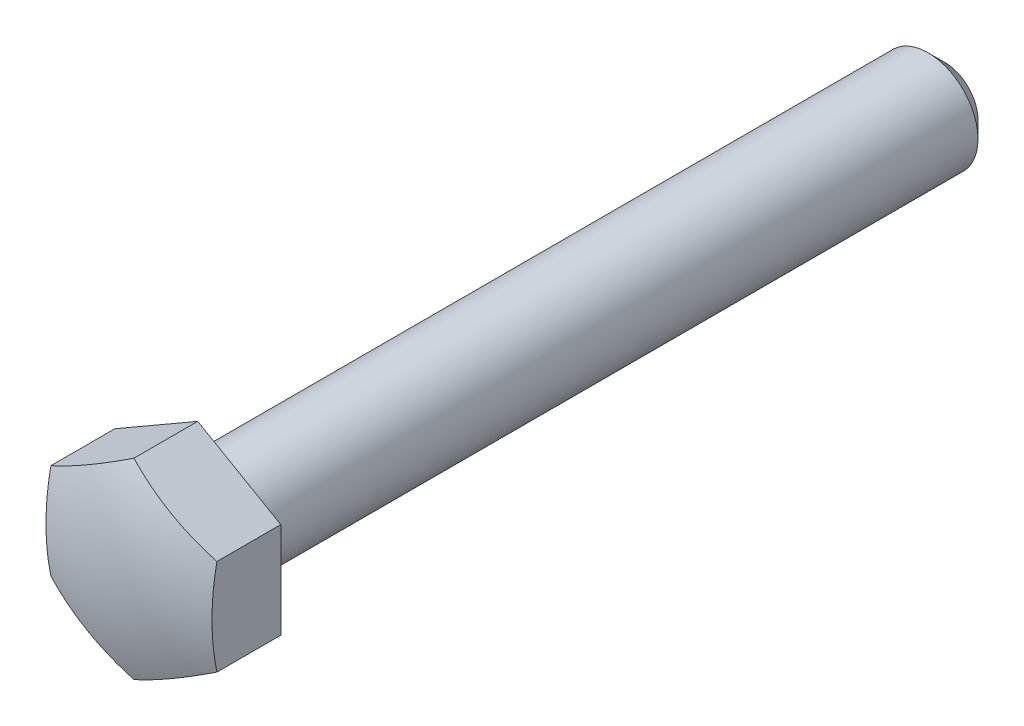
ISO-10303-21;
HEADER;
FILE_DESCRIPTION(('STEP AP214'),'2;1');
FILE_NAME('part.step','',(''),(''),'','','');
FILE_SCHEMA(('AUTOMOTIVE_DESIGN { 1 0 10303 214 1 1 1 1 }'));
ENDSEC;
DATA;
#1=APPLICATION_CONTEXT('core data for automotive mechanical design processes');
#2=APPLICATION_PROTOCOL_DEFINITION('international standard','automotive_design',2000,#1);
#3=PRODUCT_CONTEXT('',#1,'mechanical');
#4=PRODUCT('Part','Part','',(#3));
#5=PRODUCT_RELATED_PRODUCT_CATEGORY('part','',(#4));
#6=PRODUCT_DEFINITION_FORMATION('','',#4);
#7=PRODUCT_DEFINITION_CONTEXT('part definition',#1,'design');
#8=PRODUCT_DEFINITION('design','',#6,#7);
#9=PRODUCT_DEFINITION_SHAPE('','',#8);
#10=(LENGTH_UNIT() NAMED_UNIT(*) SI_UNIT(.MILLI.,.METRE.));
#11=(NAMED_UNIT(*) PLANE_ANGLE_UNIT() SI_UNIT($,.RADIAN.));
#12=(NAMED_UNIT(*) SI_UNIT($,.STERADIAN.) SOLID_ANGLE_UNIT());
#13=UNCERTAINTY_MEASURE_WITH_UNIT(LENGTH_MEASURE(1.E-05),#10,'distance_accuracy_value','');
#14=(GEOMETRIC_REPRESENTATION_CONTEXT(3) GLOBAL_UNCERTAINTY_ASSIGNED_CONTEXT((#13)) GLOBAL_UNIT_ASSIGNED_CONTEXT((#10,
#11,#12)) REPRESENTATION_CONTEXT('',''));
#15=CARTESIAN_POINT('',(0.,0.,0.));
#16=DIRECTION('',(0.,0.,1.));
#17=DIRECTION('',(1.,0.,0.));
#18=AXIS2_PLACEMENT_3D('',#15,#16,#17);
#19=CARTESIAN_POINT('',(3.,0.,0.));
#20=DIRECTION('',(0.,0.,1.));
#21=DIRECTION('',(1.,0.,0.));
#22=AXIS2_PLACEMENT_3D('',#19,#20,#21);
#23=PLANE('',#22);
#24=CARTESIAN_POINT('',(0.,0.,0.));
#25=DIRECTION('',(0.,0.,1.));
#26=DIRECTION('',(1.,0.,0.));
#27=AXIS2_PLACEMENT_3D('',#24,#25,#26);
#28=CIRCLE('',#27,3.);
#29=CARTESIAN_POINT('',(3.,0.,0.));
#30=VERTEX_POINT('',#29);
#31=EDGE_CURVE('E115',#30,#30,#28,.T.);
#32=ORIENTED_EDGE('',*,*,#31,.T.);
#33=EDGE_LOOP('',(#32));
#34=FACE_BOUND('',#33,.T.);
#35=DIRECTION('',(-0.86602540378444,-0.5,0.));
#36=VECTOR('',#35,1.);
#37=CARTESIAN_POINT('',(5.,-2.88675134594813,0.));
#38=LINE('',#37,#36);
#39=CARTESIAN_POINT('',(5.,-2.88675134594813,0.));
#40=VERTEX_POINT('',#39);
#41=CARTESIAN_POINT('',(0.,-5.77350269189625,0.));
#42=VERTEX_POINT('',#41);
#43=EDGE_CURVE('E89',#40,#42,#38,.T.);
#44=ORIENTED_EDGE('',*,*,#43,.T.);
#45=DIRECTION('',(0.86602540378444,-0.5,0.));
#46=VECTOR('',#45,1.);
#47=CARTESIAN_POINT('',(-5.,-2.88675134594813,0.));
#48=LINE('',#47,#46);
#49=CARTESIAN_POINT('',(-5.,-2.88675134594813,0.));
#50=VERTEX_POINT('',#49);
#51=EDGE_CURVE('E87',#50,#42,#48,.T.);
#52=ORIENTED_EDGE('',*,*,#51,.F.);
#53=DIRECTION('',(0.,-1.,0.));
#54=VECTOR('',#53,1.);
#55=CARTESIAN_POINT('',(-5.,2.88675134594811,0.));
#56=LINE('',#55,#54);
#57=CARTESIAN_POINT('',(-5.,2.88675134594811,0.));
#58=VERTEX_POINT('',#57);
#59=EDGE_CURVE('E37',#58,#50,#56,.T.);
#60=ORIENTED_EDGE('',*,*,#59,.F.);
#61=DIRECTION('',(0.866025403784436,0.5,0.));
#62=VECTOR('',#61,1.);
#63=CARTESIAN_POINT('',(-5.,2.88675134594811,0.));
#64=LINE('',#63,#62);
#65=CARTESIAN_POINT('',(0.,5.77350269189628,0.));
#66=VERTEX_POINT('',#65);
#67=EDGE_CURVE('E77',#58,#66,#64,.T.);
#68=ORIENTED_EDGE('',*,*,#67,.T.);
#69=DIRECTION('',(-0.866025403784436,0.5,0.));
#70=VECTOR('',#69,1.);
#71=CARTESIAN_POINT('',(5.,2.88675134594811,0.));
#72=LINE('',#71,#70);
#73=CARTESIAN_POINT('',(5.,2.88675134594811,0.));
#74=VERTEX_POINT('',#73);
#75=EDGE_CURVE('E83',#74,#66,#72,.T.);
#76=ORIENTED_EDGE('',*,*,#75,.F.);
#77=DIRECTION('',(0.,-1.,0.));
#78=VECTOR('',#77,1.);
#79=CARTESIAN_POINT('',(5.,2.88675134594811,0.));
#80=LINE('',#79,#78);
#81=EDGE_CURVE('E95',#74,#40,#80,.T.);
#82=ORIENTED_EDGE('',*,*,#81,.T.);
#83=EDGE_LOOP('',(#44,#52,#60,#68,#76,#82));
#84=FACE_BOUND('',#83,.T.);
#85=ADVANCED_FACE('F14',(#34,#84),#23,.F.);
#86=CARTESIAN_POINT('',(0.,0.,15.));
#87=DIRECTION('',(0.,0.,1.));
#88=DIRECTION('',(1.,0.,0.));
#89=AXIS2_PLACEMENT_3D('',#86,#87,#88);
#90=CYLINDRICAL_SURFACE('',#89,3.);
#91=CARTESIAN_POINT('',(0.,0.,-44.));
#92=DIRECTION('',(0.,0.,1.));
#93=DIRECTION('',(1.,0.,0.));
#94=AXIS2_PLACEMENT_3D('',#91,#92,#93);
#95=CIRCLE('',#94,3.);
#96=CARTESIAN_POINT('',(3.,0.,-44.));
#97=VERTEX_POINT('',#96);
#98=EDGE_CURVE('E22',#97,#97,#95,.T.);
#99=ORIENTED_EDGE('',*,*,#98,.T.);
#100=EDGE_LOOP('',(#99));
#101=FACE_BOUND('',#100,.T.);
#102=ORIENTED_EDGE('',*,*,#31,.F.);
#103=EDGE_LOOP('',(#102));
#104=FACE_BOUND('',#103,.T.);
#105=ADVANCED_FACE('F120',(#101,#104),#90,.T.);
#106=CARTESIAN_POINT('',(0.,0.,-45.));
#107=DIRECTION('',(0.,0.,1.));
#108=DIRECTION('',(1.,0.,0.));
#109=AXIS2_PLACEMENT_3D('',#106,#107,#108);
#110=PLANE('',#109);
#111=CARTESIAN_POINT('',(0.,0.,-45.));
#112=DIRECTION('',(0.,0.,1.));
#113=DIRECTION('',(1.,0.,0.));
#114=AXIS2_PLACEMENT_3D('',#111,#112,#113);
#115=CIRCLE('',#114,2.);
#116=CARTESIAN_POINT('',(2.,0.,-45.));
#117=VERTEX_POINT('',#116);
#118=EDGE_CURVE('E9',#117,#117,#115,.F.);
#119=ORIENTED_EDGE('',*,*,#118,.T.);
#120=EDGE_LOOP('',(#119));
#121=FACE_BOUND('',#120,.T.);
#122=ADVANCED_FACE('F141',(#121),#110,.F.);
#123=CARTESIAN_POINT('',(5.,-2.88675134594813,5.));
#124=DIRECTION('',(0.5,-0.86602540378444,0.));
#125=DIRECTION('',(0.86602540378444,0.5,0.));
#126=AXIS2_PLACEMENT_3D('',#123,#124,#125);
#127=PLANE('',#126);
#128=DIRECTION('',(0.,0.,-1.));
#129=VECTOR('',#128,1.);
#130=CARTESIAN_POINT('',(0.,-5.77350269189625,5.));
#131=LINE('',#130,#129);
#132=CARTESIAN_POINT('',(0.,-5.77350269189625,3.8443731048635));
#133=VERTEX_POINT('',#132);
#134=EDGE_CURVE('E29',#133,#42,#131,.T.);
#135=ORIENTED_EDGE('',*,*,#134,.T.);
#136=ORIENTED_EDGE('',*,*,#43,.F.);
#137=DIRECTION('',(0.,0.,-1.));
#138=VECTOR('',#137,1.);
#139=CARTESIAN_POINT('',(5.,-2.88675134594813,5.));
#140=LINE('',#139,#138);
#141=CARTESIAN_POINT('',(5.,-2.88675134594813,3.8443731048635));
#142=VERTEX_POINT('',#141);
#143=EDGE_CURVE('E100',#142,#40,#140,.T.);
#144=ORIENTED_EDGE('',*,*,#143,.F.);
#145=CARTESIAN_POINT('',(2.5,-4.3301270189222,-10.));
#146=DIRECTION('',(0.5,-0.86602540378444,0.));
#147=DIRECTION('',(0.86602540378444,0.5,0.));
#148=AXIS2_PLACEMENT_3D('',#145,#146,#147);
#149=CIRCLE('',#148,14.1421356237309);
#150=EDGE_CURVE('E112',#133,#142,#149,.F.);
#151=ORIENTED_EDGE('',*,*,#150,.F.);
#152=EDGE_LOOP('',(#135,#136,#144,#151));
#153=FACE_BOUND('',#152,.T.);
#154=ADVANCED_FACE('F146',(#153),#127,.T.);
#155=CARTESIAN_POINT('',(5.,2.88675134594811,5.));
#156=DIRECTION('',(1.,0.,0.));
#157=DIRECTION('',(0.,0.,-1.));
#158=AXIS2_PLACEMENT_3D('',#155,#156,#157);
#159=PLANE('',#158);
#160=ORIENTED_EDGE('',*,*,#143,.T.);
#161=ORIENTED_EDGE('',*,*,#81,.F.);
#162=DIRECTION('',(0.,0.,-1.));
#163=VECTOR('',#162,1.);
#164=CARTESIAN_POINT('',(5.,2.88675134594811,5.));
#165=LINE('',#164,#163);
#166=CARTESIAN_POINT('',(5.,2.88675134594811,3.8443731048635));
#167=VERTEX_POINT('',#166);
#168=EDGE_CURVE('E98',#167,#74,#165,.T.);
#169=ORIENTED_EDGE('',*,*,#168,.F.);
#170=CARTESIAN_POINT('',(5.,0.,-10.));
#171=DIRECTION('',(1.,0.,0.));
#172=DIRECTION('',(0.,0.,-1.));
#173=AXIS2_PLACEMENT_3D('',#170,#171,#172);
#174=CIRCLE('',#173,14.1421356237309);
#175=EDGE_CURVE('E109',#142,#167,#174,.F.);
#176=ORIENTED_EDGE('',*,*,#175,.F.);
#177=EDGE_LOOP('',(#160,#161,#169,#176));
#178=FACE_BOUND('',#177,.T.);
#179=ADVANCED_FACE('F148',(#178),#159,.T.);
#180=CARTESIAN_POINT('',(5.,2.88675134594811,5.));
#181=DIRECTION('',(-0.5,-0.866025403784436,0.));
#182=DIRECTION('',(0.866025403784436,-0.5,0.));
#183=AXIS2_PLACEMENT_3D('',#180,#181,#182);
#184=PLANE('',#183);
#185=CARTESIAN_POINT('',(2.5,4.33012701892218,-10.));
#186=DIRECTION('',(-0.5,-0.866025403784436,0.));
#187=DIRECTION('',(0.866025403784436,-0.5,0.));
#188=AXIS2_PLACEMENT_3D('',#185,#186,#187);
#189=CIRCLE('',#188,14.1421356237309);
#190=CARTESIAN_POINT('',(0.,5.77350269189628,3.8443731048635));
#191=VERTEX_POINT('',#190);
#192=EDGE_CURVE('E107',#191,#167,#189,.F.);
#193=ORIENTED_EDGE('',*,*,#192,.T.);
#194=ORIENTED_EDGE('',*,*,#168,.T.);
#195=ORIENTED_EDGE('',*,*,#75,.T.);
#196=DIRECTION('',(0.,0.,-1.));
#197=VECTOR('',#196,1.);
#198=CARTESIAN_POINT('',(0.,5.77350269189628,5.));
#199=LINE('',#198,#197);
#200=EDGE_CURVE('E73',#191,#66,#199,.T.);
#201=ORIENTED_EDGE('',*,*,#200,.F.);
#202=EDGE_LOOP('',(#193,#194,#195,#201));
#203=FACE_BOUND('',#202,.T.);
#204=ADVANCED_FACE('F151',(#203),#184,.F.);
#205=CARTESIAN_POINT('',(-5.,2.88675134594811,5.));
#206=DIRECTION('',(-0.5,0.866025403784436,0.));
#207=DIRECTION('',(-0.866025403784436,-0.5,0.));
#208=AXIS2_PLACEMENT_3D('',#205,#206,#207);
#209=PLANE('',#208);
#210=ORIENTED_EDGE('',*,*,#200,.T.);
#211=ORIENTED_EDGE('',*,*,#67,.F.);
#212=DIRECTION('',(0.,0.,-1.));
#213=VECTOR('',#212,1.);
#214=CARTESIAN_POINT('',(-5.,2.88675134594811,5.));
#215=LINE('',#214,#213);
#216=CARTESIAN_POINT('',(-5.,2.88675134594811,3.8443731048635));
#217=VERTEX_POINT('',#216);
#218=EDGE_CURVE('E66',#217,#58,#215,.T.);
#219=ORIENTED_EDGE('',*,*,#218,.F.);
#220=CARTESIAN_POINT('',(-2.5,4.33012701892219,-10.));
#221=DIRECTION('',(-0.5,0.866025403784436,0.));
#222=DIRECTION('',(-0.866025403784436,-0.5,0.));
#223=AXIS2_PLACEMENT_3D('',#220,#221,#222);
#224=CIRCLE('',#223,14.1421356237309);
#225=EDGE_CURVE('E105',#191,#217,#224,.F.);
#226=ORIENTED_EDGE('',*,*,#225,.F.);
#227=EDGE_LOOP('',(#210,#211,#219,#226));
#228=FACE_BOUND('',#227,.T.);
#229=ADVANCED_FACE('F78',(#228),#209,.T.);
#230=CARTESIAN_POINT('',(-5.,2.88675134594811,5.));
#231=DIRECTION('',(1.,0.,0.));
#232=DIRECTION('',(0.,1.,0.));
#233=AXIS2_PLACEMENT_3D('',#230,#231,#232);
#234=PLANE('',#233);
#235=CARTESIAN_POINT('',(-5.,0.,-10.));
#236=DIRECTION('',(1.,0.,0.));
#237=DIRECTION('',(0.,1.,0.));
#238=AXIS2_PLACEMENT_3D('',#235,#236,#237);
#239=CIRCLE('',#238,14.1421356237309);
#240=CARTESIAN_POINT('',(-5.,-2.88675134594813,3.8443731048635));
#241=VERTEX_POINT('',#240);
#242=EDGE_CURVE('E70',#241,#217,#239,.F.);
#243=ORIENTED_EDGE('',*,*,#242,.T.);
#244=ORIENTED_EDGE('',*,*,#218,.T.);
#245=ORIENTED_EDGE('',*,*,#59,.T.);
#246=DIRECTION('',(0.,0.,-1.));
#247=VECTOR('',#246,1.);
#248=CARTESIAN_POINT('',(-5.,-2.88675134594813,5.));
#249=LINE('',#248,#247);
#250=EDGE_CURVE('E74',#241,#50,#249,.T.);
#251=ORIENTED_EDGE('',*,*,#250,.F.);
#252=EDGE_LOOP('',(#243,#244,#245,#251));
#253=FACE_BOUND('',#252,.T.);
#254=ADVANCED_FACE('F68',(#253),#234,.F.);
#255=CARTESIAN_POINT('',(-5.,-2.88675134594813,5.));
#256=DIRECTION('',(0.5,0.86602540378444,0.));
#257=DIRECTION('',(-0.86602540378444,0.5,0.));
#258=AXIS2_PLACEMENT_3D('',#255,#256,#257);
#259=PLANE('',#258);
#260=CARTESIAN_POINT('',(-2.5,-4.3301270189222,-10.));
#261=DIRECTION('',(0.5,0.86602540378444,0.));
#262=DIRECTION('',(-0.86602540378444,0.5,0.));
#263=AXIS2_PLACEMENT_3D('',#260,#261,#262);
#264=CIRCLE('',#263,14.1421356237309);
#265=EDGE_CURVE('E102',#133,#241,#264,.F.);
#266=ORIENTED_EDGE('',*,*,#265,.T.);
#267=ORIENTED_EDGE('',*,*,#250,.T.);
#268=ORIENTED_EDGE('',*,*,#51,.T.);
#269=ORIENTED_EDGE('',*,*,#134,.F.);
#270=EDGE_LOOP('',(#266,#267,#268,#269));
#271=FACE_BOUND('',#270,.T.);
#272=ADVANCED_FACE('F131',(#271),#259,.F.);
#273=CARTESIAN_POINT('',(0.,0.,-10.));
#274=DIRECTION('',(0.,0.,1.));
#275=DIRECTION('',(1.,0.,0.));
#276=AXIS2_PLACEMENT_3D('',#273,#274,#275);
#277=SPHERICAL_SURFACE('',#276,15.);
#278=ORIENTED_EDGE('',*,*,#265,.F.);
#279=ORIENTED_EDGE('',*,*,#150,.T.);
#280=ORIENTED_EDGE('',*,*,#175,.T.);
#281=ORIENTED_EDGE('',*,*,#192,.F.);
#282=ORIENTED_EDGE('',*,*,#225,.T.);
#283=ORIENTED_EDGE('',*,*,#242,.F.);
#284=EDGE_LOOP('',(#278,#279,#280,#281,#282,#283));
#285=FACE_BOUND('',#284,.T.);
#286=ADVANCED_FACE('F124',(#285),#277,.T.);
#287=CARTESIAN_POINT('',(0.,0.,-44.));
#288=DIRECTION('',(0.,0.,1.));
#289=DIRECTION('',(1.,0.,0.));
#290=AXIS2_PLACEMENT_3D('',#287,#288,#289);
#291=CONICAL_SURFACE('',#290,3.,0.78539816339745);
#292=ORIENTED_EDGE('',*,*,#118,.F.);
#293=EDGE_LOOP('',(#292));
#294=FACE_BOUND('',#293,.T.);
#295=ORIENTED_EDGE('',*,*,#98,.F.);
#296=EDGE_LOOP('',(#295));
#297=FACE_BOUND('',#296,.T.);
#298=ADVANCED_FACE('F16',(#294,#297),#291,.T.);
#299=CLOSED_SHELL('',(#85,#105,#122,#154,#179,#204,#229,#254,#272,#286,#298));
#300=MANIFOLD_SOLID_BREP('B1',#299);
#301=ADVANCED_BREP_SHAPE_REPRESENTATION('',(#18,#300),#14);
#302=SHAPE_DEFINITION_REPRESENTATION(#9,#301);
ENDSEC;
END-ISO-10303-21;
